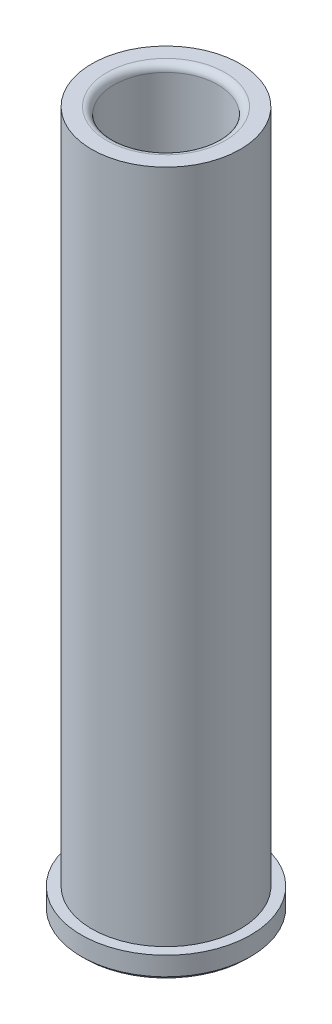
ISO-10303-21;
HEADER;
FILE_DESCRIPTION(('STEP AP214'),'2;1');
FILE_NAME('part.step','',(''),(''),'','','');
FILE_SCHEMA(('AUTOMOTIVE_DESIGN { 1 0 10303 214 1 1 1 1 }'));
ENDSEC;
DATA;
#1=APPLICATION_CONTEXT('core data for automotive mechanical design processes');
#2=APPLICATION_PROTOCOL_DEFINITION('international standard','automotive_design',2000,#1);
#3=PRODUCT_CONTEXT('',#1,'mechanical');
#4=PRODUCT('Part','Part','',(#3));
#5=PRODUCT_RELATED_PRODUCT_CATEGORY('part','',(#4));
#6=PRODUCT_DEFINITION_FORMATION('','',#4);
#7=PRODUCT_DEFINITION_CONTEXT('part definition',#1,'design');
#8=PRODUCT_DEFINITION('design','',#6,#7);
#9=PRODUCT_DEFINITION_SHAPE('','',#8);
#10=(LENGTH_UNIT() NAMED_UNIT(*) SI_UNIT(.MILLI.,.METRE.));
#11=(NAMED_UNIT(*) PLANE_ANGLE_UNIT() SI_UNIT($,.RADIAN.));
#12=(NAMED_UNIT(*) SI_UNIT($,.STERADIAN.) SOLID_ANGLE_UNIT());
#13=UNCERTAINTY_MEASURE_WITH_UNIT(LENGTH_MEASURE(1.E-05),#10,'distance_accuracy_value','');
#14=(GEOMETRIC_REPRESENTATION_CONTEXT(3) GLOBAL_UNCERTAINTY_ASSIGNED_CONTEXT((#13)) GLOBAL_UNIT_ASSIGNED_CONTEXT((#10,
#11,#12)) REPRESENTATION_CONTEXT('',''));
#15=CARTESIAN_POINT('',(0.,0.,0.));
#16=DIRECTION('',(0.,0.,1.));
#17=DIRECTION('',(1.,0.,0.));
#18=AXIS2_PLACEMENT_3D('',#15,#16,#17);
#19=CARTESIAN_POINT('',(3.49148336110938E-12,-1000.,0.));
#20=DIRECTION('',(0.,-1.,0.));
#21=DIRECTION('',(1.,0.,0.));
#22=AXIS2_PLACEMENT_3D('',#19,#20,#21);
#23=CYLINDRICAL_SURFACE('',#22,15.8813499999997);
#24=CARTESIAN_POINT('',(0.,4.7625,0.));
#25=DIRECTION('',(0.,-1.,0.));
#26=DIRECTION('',(1.,0.,0.));
#27=AXIS2_PLACEMENT_3D('',#24,#25,#26);
#28=CIRCLE('',#27,15.88135);
#29=CARTESIAN_POINT('',(15.8813499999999,4.76250000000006,0.));
#30=VERTEX_POINT('',#29);
#31=EDGE_CURVE('E60',#30,#30,#28,.T.);
#32=ORIENTED_EDGE('',*,*,#31,.F.);
#33=EDGE_LOOP('',(#32));
#34=FACE_BOUND('',#33,.T.);
#35=CARTESIAN_POINT('',(-5.21016604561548E-13,149.225,0.));
#36=DIRECTION('',(0.,-1.,0.));
#37=DIRECTION('',(1.,0.,0.));
#38=AXIS2_PLACEMENT_3D('',#35,#36,#37);
#39=CIRCLE('',#38,15.8813499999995);
#40=CARTESIAN_POINT('',(15.881349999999,149.225,0.));
#41=VERTEX_POINT('',#40);
#42=EDGE_CURVE('E39',#41,#41,#39,.T.);
#43=ORIENTED_EDGE('',*,*,#42,.T.);
#44=EDGE_LOOP('',(#43));
#45=FACE_BOUND('',#44,.T.);
#46=ADVANCED_FACE('F28',(#34,#45),#23,.T.);
#47=CARTESIAN_POINT('',(-15.88135,149.225,0.));
#48=DIRECTION('',(0.,-1.,0.));
#49=DIRECTION('',(1.,0.,0.));
#50=AXIS2_PLACEMENT_3D('',#47,#48,#49);
#51=PLANE('',#50);
#52=CARTESIAN_POINT('',(-5.21016604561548E-13,149.225,0.));
#53=DIRECTION('',(0.,-1.,0.));
#54=DIRECTION('',(1.,0.,0.));
#55=AXIS2_PLACEMENT_3D('',#52,#53,#54);
#56=CIRCLE('',#55,12.6428499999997);
#57=CARTESIAN_POINT('',(12.6428499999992,149.225,0.));
#58=VERTEX_POINT('',#57);
#59=EDGE_CURVE('E35',#58,#58,#56,.T.);
#60=ORIENTED_EDGE('',*,*,#59,.T.);
#61=EDGE_LOOP('',(#60));
#62=FACE_BOUND('',#61,.T.);
#63=ORIENTED_EDGE('',*,*,#42,.F.);
#64=EDGE_LOOP('',(#63));
#65=FACE_BOUND('',#64,.T.);
#66=ADVANCED_FACE('F68',(#62,#65),#51,.F.);
#67=CARTESIAN_POINT('',(3.49148336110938E-12,-1000.,0.));
#68=DIRECTION('',(0.,-1.,0.));
#69=DIRECTION('',(1.,0.,0.));
#70=AXIS2_PLACEMENT_3D('',#67,#68,#69);
#71=CYLINDRICAL_SURFACE('',#70,11.1188499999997);
#72=CARTESIAN_POINT('',(-5.15695583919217E-13,147.701,0.));
#73=DIRECTION('',(0.,-1.,0.));
#74=DIRECTION('',(1.,0.,0.));
#75=AXIS2_PLACEMENT_3D('',#72,#73,#74);
#76=CIRCLE('',#75,11.1188499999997);
#77=CARTESIAN_POINT('',(11.1188499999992,147.701,0.));
#78=VERTEX_POINT('',#77);
#79=EDGE_CURVE('E10',#78,#78,#76,.F.);
#80=ORIENTED_EDGE('',*,*,#79,.T.);
#81=EDGE_LOOP('',(#80));
#82=FACE_BOUND('',#81,.T.);
#83=CARTESIAN_POINT('',(0.,0.761999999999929,0.));
#84=DIRECTION('',(0.,-1.,0.));
#85=DIRECTION('',(1.,0.,0.));
#86=AXIS2_PLACEMENT_3D('',#83,#84,#85);
#87=CIRCLE('',#86,11.11885);
#88=CARTESIAN_POINT('',(11.11885,0.761999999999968,0.));
#89=VERTEX_POINT('',#88);
#90=EDGE_CURVE('E43',#89,#89,#87,.T.);
#91=ORIENTED_EDGE('',*,*,#90,.T.);
#92=EDGE_LOOP('',(#91));
#93=FACE_BOUND('',#92,.T.);
#94=ADVANCED_FACE('F72',(#82,#93),#71,.F.);
#95=CARTESIAN_POINT('',(0.,0.,0.));
#96=DIRECTION('',(0.,-1.,0.));
#97=DIRECTION('',(1.,0.,0.));
#98=AXIS2_PLACEMENT_3D('',#95,#96,#97);
#99=CONICAL_SURFACE('',#98,11.88085,0.785398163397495);
#100=ORIENTED_EDGE('',*,*,#90,.F.);
#101=EDGE_LOOP('',(#100));
#102=FACE_BOUND('',#101,.T.);
#103=CARTESIAN_POINT('',(0.,0.,0.));
#104=DIRECTION('',(0.,-1.,0.));
#105=DIRECTION('',(1.,0.,0.));
#106=AXIS2_PLACEMENT_3D('',#103,#104,#105);
#107=CIRCLE('',#106,11.88085);
#108=CARTESIAN_POINT('',(11.88085,0.,0.));
#109=VERTEX_POINT('',#108);
#110=EDGE_CURVE('E48',#109,#109,#107,.T.);
#111=ORIENTED_EDGE('',*,*,#110,.T.);
#112=EDGE_LOOP('',(#111));
#113=FACE_BOUND('',#112,.T.);
#114=ADVANCED_FACE('F77',(#102,#113),#99,.F.);
#115=CARTESIAN_POINT('',(-11.88085,0.,0.));
#116=DIRECTION('',(0.,1.,0.));
#117=DIRECTION('',(-1.,0.,0.));
#118=AXIS2_PLACEMENT_3D('',#115,#116,#117);
#119=PLANE('',#118);
#120=ORIENTED_EDGE('',*,*,#110,.F.);
#121=EDGE_LOOP('',(#120));
#122=FACE_BOUND('',#121,.T.);
#123=CARTESIAN_POINT('',(0.,0.,0.));
#124=DIRECTION('',(0.,-1.,0.));
#125=DIRECTION('',(1.,0.,0.));
#126=AXIS2_PLACEMENT_3D('',#123,#124,#125);
#127=CIRCLE('',#126,17.3609);
#128=CARTESIAN_POINT('',(17.3609,0.,0.));
#129=VERTEX_POINT('',#128);
#130=EDGE_CURVE('E51',#129,#129,#127,.T.);
#131=ORIENTED_EDGE('',*,*,#130,.T.);
#132=EDGE_LOOP('',(#131));
#133=FACE_BOUND('',#132,.T.);
#134=ADVANCED_FACE('F82',(#122,#133),#119,.F.);
#135=CARTESIAN_POINT('',(0.,0.761999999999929,0.));
#136=DIRECTION('',(0.,1.,0.));
#137=DIRECTION('',(-1.,0.,0.));
#138=AXIS2_PLACEMENT_3D('',#135,#136,#137);
#139=CONICAL_SURFACE('',#138,18.1229,0.785398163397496);
#140=ORIENTED_EDGE('',*,*,#130,.F.);
#141=EDGE_LOOP('',(#140));
#142=FACE_BOUND('',#141,.T.);
#143=CARTESIAN_POINT('',(0.,0.761999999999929,0.));
#144=DIRECTION('',(0.,-1.,0.));
#145=DIRECTION('',(1.,0.,0.));
#146=AXIS2_PLACEMENT_3D('',#143,#144,#145);
#147=CIRCLE('',#146,18.1229);
#148=CARTESIAN_POINT('',(18.1229,0.761999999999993,0.));
#149=VERTEX_POINT('',#148);
#150=EDGE_CURVE('E54',#149,#149,#147,.T.);
#151=ORIENTED_EDGE('',*,*,#150,.T.);
#152=EDGE_LOOP('',(#151));
#153=FACE_BOUND('',#152,.T.);
#154=ADVANCED_FACE('F86',(#142,#153),#139,.T.);
#155=CARTESIAN_POINT('',(3.49148336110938E-12,-1000.,0.));
#156=DIRECTION('',(0.,-1.,0.));
#157=DIRECTION('',(1.,0.,0.));
#158=AXIS2_PLACEMENT_3D('',#155,#156,#157);
#159=CYLINDRICAL_SURFACE('',#158,18.1229);
#160=ORIENTED_EDGE('',*,*,#150,.F.);
#161=EDGE_LOOP('',(#160));
#162=FACE_BOUND('',#161,.T.);
#163=CARTESIAN_POINT('',(0.,4.7625,0.));
#164=DIRECTION('',(0.,-1.,0.));
#165=DIRECTION('',(1.,0.,0.));
#166=AXIS2_PLACEMENT_3D('',#163,#164,#165);
#167=CIRCLE('',#166,18.1229);
#168=CARTESIAN_POINT('',(18.1229,4.76250000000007,0.));
#169=VERTEX_POINT('',#168);
#170=EDGE_CURVE('E57',#169,#169,#167,.T.);
#171=ORIENTED_EDGE('',*,*,#170,.T.);
#172=EDGE_LOOP('',(#171));
#173=FACE_BOUND('',#172,.T.);
#174=ADVANCED_FACE('F90',(#162,#173),#159,.T.);
#175=CARTESIAN_POINT('',(-18.1229,4.76249999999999,0.));
#176=DIRECTION('',(0.,-1.,0.));
#177=DIRECTION('',(1.,0.,0.));
#178=AXIS2_PLACEMENT_3D('',#175,#176,#177);
#179=PLANE('',#178);
#180=ORIENTED_EDGE('',*,*,#170,.F.);
#181=EDGE_LOOP('',(#180));
#182=FACE_BOUND('',#181,.T.);
#183=ORIENTED_EDGE('',*,*,#31,.T.);
#184=EDGE_LOOP('',(#183));
#185=FACE_BOUND('',#184,.T.);
#186=ADVANCED_FACE('F64',(#182,#185),#179,.F.);
#187=CARTESIAN_POINT('',(-5.15695583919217E-13,147.701,0.));
#188=DIRECTION('',(0.,-1.,0.));
#189=DIRECTION('',(1.,0.,0.));
#190=AXIS2_PLACEMENT_3D('',#187,#188,#189);
#191=TOROIDAL_SURFACE('',#190,12.6428499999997,1.524);
#192=ORIENTED_EDGE('',*,*,#79,.F.);
#193=EDGE_LOOP('',(#192));
#194=FACE_BOUND('',#193,.T.);
#195=ORIENTED_EDGE('',*,*,#59,.F.);
#196=EDGE_LOOP('',(#195));
#197=FACE_BOUND('',#196,.T.);
#198=ADVANCED_FACE('F30',(#194,#197),#191,.T.);
#199=CLOSED_SHELL('',(#46,#66,#94,#114,#134,#154,#174,#186,#198));
#200=MANIFOLD_SOLID_BREP('B2',#199);
#201=ADVANCED_BREP_SHAPE_REPRESENTATION('',(#18,#200),#14);
#202=SHAPE_DEFINITION_REPRESENTATION(#9,#201);
ENDSEC;
END-ISO-10303-21;
